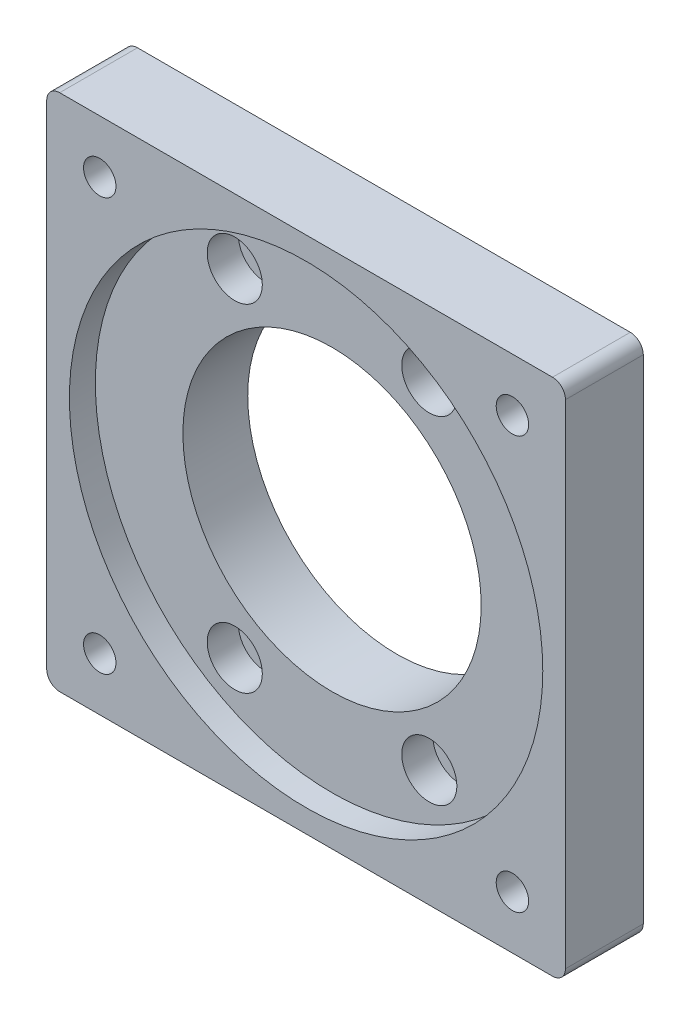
ISO-10303-21;
HEADER;
FILE_DESCRIPTION(('STEP AP214'),'2;1');
FILE_NAME('part.step','',(''),(''),'','','');
FILE_SCHEMA(('AUTOMOTIVE_DESIGN { 1 0 10303 214 1 1 1 1 }'));
ENDSEC;
DATA;
#1=APPLICATION_CONTEXT('core data for automotive mechanical design processes');
#2=APPLICATION_PROTOCOL_DEFINITION('international standard','automotive_design',2000,#1);
#3=PRODUCT_CONTEXT('',#1,'mechanical');
#4=PRODUCT('Part','Part','',(#3));
#5=PRODUCT_RELATED_PRODUCT_CATEGORY('part','',(#4));
#6=PRODUCT_DEFINITION_FORMATION('','',#4);
#7=PRODUCT_DEFINITION_CONTEXT('part definition',#1,'design');
#8=PRODUCT_DEFINITION('design','',#6,#7);
#9=PRODUCT_DEFINITION_SHAPE('','',#8);
#10=(LENGTH_UNIT() NAMED_UNIT(*) SI_UNIT(.MILLI.,.METRE.));
#11=(NAMED_UNIT(*) PLANE_ANGLE_UNIT() SI_UNIT($,.RADIAN.));
#12=(NAMED_UNIT(*) SI_UNIT($,.STERADIAN.) SOLID_ANGLE_UNIT());
#13=UNCERTAINTY_MEASURE_WITH_UNIT(LENGTH_MEASURE(1.E-05),#10,'distance_accuracy_value','');
#14=(GEOMETRIC_REPRESENTATION_CONTEXT(3) GLOBAL_UNCERTAINTY_ASSIGNED_CONTEXT((#13)) GLOBAL_UNIT_ASSIGNED_CONTEXT((#10,
#11,#12)) REPRESENTATION_CONTEXT('',''));
#15=CARTESIAN_POINT('',(0.,0.,0.));
#16=DIRECTION('',(0.,0.,1.));
#17=DIRECTION('',(1.,0.,0.));
#18=AXIS2_PLACEMENT_3D('',#15,#16,#17);
#19=CARTESIAN_POINT('',(0.,0.,12.));
#20=DIRECTION('',(0.,0.,-1.));
#21=DIRECTION('',(-1.,0.,0.));
#22=AXIS2_PLACEMENT_3D('',#19,#20,#21);
#23=PLANE('',#22);
#24=CARTESIAN_POINT('',(-31.8198051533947,31.8198051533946,12.));
#25=DIRECTION('',(0.,0.,1.));
#26=DIRECTION('',(1.,0.,0.));
#27=AXIS2_PLACEMENT_3D('',#24,#25,#26);
#28=CIRCLE('',#27,2.5);
#29=CARTESIAN_POINT('',(-29.3198051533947,31.8198051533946,12.));
#30=VERTEX_POINT('',#29);
#31=EDGE_CURVE('E267',#30,#30,#28,.T.);
#32=ORIENTED_EDGE('',*,*,#31,.F.);
#33=EDGE_LOOP('',(#32));
#34=FACE_BOUND('',#33,.T.);
#35=DIRECTION('',(-1.,0.,0.));
#36=VECTOR('',#35,1.);
#37=CARTESIAN_POINT('',(-40.,40.,12.));
#38=LINE('',#37,#36);
#39=CARTESIAN_POINT('',(38.,40.,12.));
#40=VERTEX_POINT('',#39);
#41=CARTESIAN_POINT('',(-38.,40.,12.));
#42=VERTEX_POINT('',#41);
#43=EDGE_CURVE('E198',#40,#42,#38,.T.);
#44=ORIENTED_EDGE('',*,*,#43,.T.);
#45=CARTESIAN_POINT('',(-38.,38.,12.));
#46=DIRECTION('',(0.,0.,-1.));
#47=DIRECTION('',(-1.,0.,0.));
#48=AXIS2_PLACEMENT_3D('',#45,#46,#47);
#49=CIRCLE('',#48,2.);
#50=CARTESIAN_POINT('',(-40.,38.,12.));
#51=VERTEX_POINT('',#50);
#52=EDGE_CURVE('E178',#42,#51,#49,.F.);
#53=ORIENTED_EDGE('',*,*,#52,.T.);
#54=DIRECTION('',(0.,-1.,0.));
#55=VECTOR('',#54,1.);
#56=CARTESIAN_POINT('',(-40.,-40.,12.));
#57=LINE('',#56,#55);
#58=CARTESIAN_POINT('',(-40.,-38.,12.));
#59=VERTEX_POINT('',#58);
#60=EDGE_CURVE('E124',#51,#59,#57,.T.);
#61=ORIENTED_EDGE('',*,*,#60,.T.);
#62=CARTESIAN_POINT('',(-38.,-38.,12.));
#63=DIRECTION('',(0.,0.,-1.));
#64=DIRECTION('',(-1.,0.,0.));
#65=AXIS2_PLACEMENT_3D('',#62,#63,#64);
#66=CIRCLE('',#65,2.);
#67=CARTESIAN_POINT('',(-38.,-40.,12.));
#68=VERTEX_POINT('',#67);
#69=EDGE_CURVE('E60',#59,#68,#66,.F.);
#70=ORIENTED_EDGE('',*,*,#69,.T.);
#71=DIRECTION('',(1.,0.,0.));
#72=VECTOR('',#71,1.);
#73=CARTESIAN_POINT('',(-40.,-40.,12.));
#74=LINE('',#73,#72);
#75=CARTESIAN_POINT('',(38.,-40.,12.));
#76=VERTEX_POINT('',#75);
#77=EDGE_CURVE('E164',#68,#76,#74,.T.);
#78=ORIENTED_EDGE('',*,*,#77,.T.);
#79=CARTESIAN_POINT('',(38.,-38.,12.));
#80=DIRECTION('',(0.,0.,-1.));
#81=DIRECTION('',(-1.,0.,0.));
#82=AXIS2_PLACEMENT_3D('',#79,#80,#81);
#83=CIRCLE('',#82,2.);
#84=CARTESIAN_POINT('',(40.,-38.,12.));
#85=VERTEX_POINT('',#84);
#86=EDGE_CURVE('E175',#76,#85,#83,.F.);
#87=ORIENTED_EDGE('',*,*,#86,.T.);
#88=DIRECTION('',(0.,1.,0.));
#89=VECTOR('',#88,1.);
#90=CARTESIAN_POINT('',(40.,-40.,12.));
#91=LINE('',#90,#89);
#92=CARTESIAN_POINT('',(40.,38.,12.));
#93=VERTEX_POINT('',#92);
#94=EDGE_CURVE('E134',#85,#93,#91,.T.);
#95=ORIENTED_EDGE('',*,*,#94,.T.);
#96=CARTESIAN_POINT('',(38.,38.,12.));
#97=DIRECTION('',(0.,0.,-1.));
#98=DIRECTION('',(-1.,0.,0.));
#99=AXIS2_PLACEMENT_3D('',#96,#97,#98);
#100=CIRCLE('',#99,2.);
#101=EDGE_CURVE('E173',#93,#40,#100,.F.);
#102=ORIENTED_EDGE('',*,*,#101,.T.);
#103=EDGE_LOOP('',(#44,#53,#61,#70,#78,#87,#95,#102));
#104=FACE_BOUND('',#103,.T.);
#105=CARTESIAN_POINT('',(0.,0.,12.));
#106=DIRECTION('',(0.,0.,1.));
#107=DIRECTION('',(1.,0.,0.));
#108=AXIS2_PLACEMENT_3D('',#105,#106,#107);
#109=CIRCLE('',#108,36.5);
#110=CARTESIAN_POINT('',(36.5,0.,12.));
#111=VERTEX_POINT('',#110);
#112=EDGE_CURVE('E207',#111,#111,#109,.T.);
#113=ORIENTED_EDGE('',*,*,#112,.F.);
#114=EDGE_LOOP('',(#113));
#115=FACE_BOUND('',#114,.T.);
#116=CARTESIAN_POINT('',(-31.8198051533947,-31.8198051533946,12.));
#117=DIRECTION('',(0.,0.,1.));
#118=DIRECTION('',(1.,0.,0.));
#119=AXIS2_PLACEMENT_3D('',#116,#117,#118);
#120=CIRCLE('',#119,2.5);
#121=CARTESIAN_POINT('',(-29.3198051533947,-31.8198051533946,12.));
#122=VERTEX_POINT('',#121);
#123=EDGE_CURVE('E252',#122,#122,#120,.T.);
#124=ORIENTED_EDGE('',*,*,#123,.F.);
#125=EDGE_LOOP('',(#124));
#126=FACE_BOUND('',#125,.T.);
#127=CARTESIAN_POINT('',(31.8198051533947,-31.8198051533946,12.));
#128=DIRECTION('',(0.,0.,1.));
#129=DIRECTION('',(1.,0.,0.));
#130=AXIS2_PLACEMENT_3D('',#127,#128,#129);
#131=CIRCLE('',#130,2.5);
#132=CARTESIAN_POINT('',(34.3198051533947,-31.8198051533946,12.));
#133=VERTEX_POINT('',#132);
#134=EDGE_CURVE('E258',#133,#133,#131,.T.);
#135=ORIENTED_EDGE('',*,*,#134,.F.);
#136=EDGE_LOOP('',(#135));
#137=FACE_BOUND('',#136,.T.);
#138=CARTESIAN_POINT('',(31.8198051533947,31.8198051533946,12.));
#139=DIRECTION('',(0.,0.,1.));
#140=DIRECTION('',(1.,0.,0.));
#141=AXIS2_PLACEMENT_3D('',#138,#139,#140);
#142=CIRCLE('',#141,2.5);
#143=CARTESIAN_POINT('',(34.3198051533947,31.8198051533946,12.));
#144=VERTEX_POINT('',#143);
#145=EDGE_CURVE('E264',#144,#144,#142,.T.);
#146=ORIENTED_EDGE('',*,*,#145,.F.);
#147=EDGE_LOOP('',(#146));
#148=FACE_BOUND('',#147,.T.);
#149=ADVANCED_FACE('F37',(#34,#104,#115,#126,#137,#148),#23,.F.);
#150=CARTESIAN_POINT('',(0.,0.,0.));
#151=DIRECTION('',(0.,0.,-1.));
#152=DIRECTION('',(-1.,0.,0.));
#153=AXIS2_PLACEMENT_3D('',#150,#151,#152);
#154=PLANE('',#153);
#155=CARTESIAN_POINT('',(-31.8198051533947,31.8198051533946,0.));
#156=DIRECTION('',(0.,0.,-1.));
#157=DIRECTION('',(-1.,0.,0.));
#158=AXIS2_PLACEMENT_3D('',#155,#156,#157);
#159=CIRCLE('',#158,2.5);
#160=CARTESIAN_POINT('',(-34.3198051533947,31.8198051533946,0.));
#161=VERTEX_POINT('',#160);
#162=EDGE_CURVE('E41',#161,#161,#159,.T.);
#163=ORIENTED_EDGE('',*,*,#162,.F.);
#164=EDGE_LOOP('',(#163));
#165=FACE_BOUND('',#164,.T.);
#166=CARTESIAN_POINT('',(31.8198051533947,31.8198051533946,0.));
#167=DIRECTION('',(0.,0.,-1.));
#168=DIRECTION('',(-1.,0.,0.));
#169=AXIS2_PLACEMENT_3D('',#166,#167,#168);
#170=CIRCLE('',#169,2.5);
#171=CARTESIAN_POINT('',(29.3198051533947,31.8198051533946,0.));
#172=VERTEX_POINT('',#171);
#173=EDGE_CURVE('E261',#172,#172,#170,.T.);
#174=ORIENTED_EDGE('',*,*,#173,.F.);
#175=EDGE_LOOP('',(#174));
#176=FACE_BOUND('',#175,.T.);
#177=CARTESIAN_POINT('',(31.8198051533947,-31.8198051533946,0.));
#178=DIRECTION('',(0.,0.,-1.));
#179=DIRECTION('',(-1.,0.,0.));
#180=AXIS2_PLACEMENT_3D('',#177,#178,#179);
#181=CIRCLE('',#180,2.5);
#182=CARTESIAN_POINT('',(29.3198051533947,-31.8198051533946,0.));
#183=VERTEX_POINT('',#182);
#184=EDGE_CURVE('E255',#183,#183,#181,.T.);
#185=ORIENTED_EDGE('',*,*,#184,.F.);
#186=EDGE_LOOP('',(#185));
#187=FACE_BOUND('',#186,.T.);
#188=CARTESIAN_POINT('',(-31.8198051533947,-31.8198051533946,0.));
#189=DIRECTION('',(0.,0.,-1.));
#190=DIRECTION('',(-1.,0.,0.));
#191=AXIS2_PLACEMENT_3D('',#188,#189,#190);
#192=CIRCLE('',#191,2.5);
#193=CARTESIAN_POINT('',(-34.3198051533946,-31.8198051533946,0.));
#194=VERTEX_POINT('',#193);
#195=EDGE_CURVE('E249',#194,#194,#192,.T.);
#196=ORIENTED_EDGE('',*,*,#195,.F.);
#197=EDGE_LOOP('',(#196));
#198=FACE_BOUND('',#197,.T.);
#199=DIRECTION('',(0.,-1.,0.));
#200=VECTOR('',#199,1.);
#201=CARTESIAN_POINT('',(-40.,-40.,0.));
#202=LINE('',#201,#200);
#203=CARTESIAN_POINT('',(-40.,38.,0.));
#204=VERTEX_POINT('',#203);
#205=CARTESIAN_POINT('',(-40.,-38.,0.));
#206=VERTEX_POINT('',#205);
#207=EDGE_CURVE('E122',#204,#206,#202,.T.);
#208=ORIENTED_EDGE('',*,*,#207,.F.);
#209=CARTESIAN_POINT('',(-38.,38.,0.));
#210=DIRECTION('',(0.,0.,-1.));
#211=DIRECTION('',(-1.,0.,0.));
#212=AXIS2_PLACEMENT_3D('',#209,#210,#211);
#213=CIRCLE('',#212,2.);
#214=CARTESIAN_POINT('',(-38.,40.,0.));
#215=VERTEX_POINT('',#214);
#216=EDGE_CURVE('E105',#204,#215,#213,.T.);
#217=ORIENTED_EDGE('',*,*,#216,.T.);
#218=DIRECTION('',(-1.,0.,0.));
#219=VECTOR('',#218,1.);
#220=CARTESIAN_POINT('',(-40.,40.,0.));
#221=LINE('',#220,#219);
#222=CARTESIAN_POINT('',(38.,40.,0.));
#223=VERTEX_POINT('',#222);
#224=EDGE_CURVE('E132',#223,#215,#221,.T.);
#225=ORIENTED_EDGE('',*,*,#224,.F.);
#226=CARTESIAN_POINT('',(38.,38.,0.));
#227=DIRECTION('',(0.,0.,-1.));
#228=DIRECTION('',(-1.,0.,0.));
#229=AXIS2_PLACEMENT_3D('',#226,#227,#228);
#230=CIRCLE('',#229,2.);
#231=CARTESIAN_POINT('',(40.,38.,0.));
#232=VERTEX_POINT('',#231);
#233=EDGE_CURVE('E125',#223,#232,#230,.T.);
#234=ORIENTED_EDGE('',*,*,#233,.T.);
#235=DIRECTION('',(0.,1.,0.));
#236=VECTOR('',#235,1.);
#237=CARTESIAN_POINT('',(40.,-40.,0.));
#238=LINE('',#237,#236);
#239=CARTESIAN_POINT('',(40.,-38.,0.));
#240=VERTEX_POINT('',#239);
#241=EDGE_CURVE('E136',#240,#232,#238,.T.);
#242=ORIENTED_EDGE('',*,*,#241,.F.);
#243=CARTESIAN_POINT('',(38.,-38.,0.));
#244=DIRECTION('',(0.,0.,-1.));
#245=DIRECTION('',(-1.,0.,0.));
#246=AXIS2_PLACEMENT_3D('',#243,#244,#245);
#247=CIRCLE('',#246,2.);
#248=CARTESIAN_POINT('',(38.,-40.,0.));
#249=VERTEX_POINT('',#248);
#250=EDGE_CURVE('E167',#240,#249,#247,.T.);
#251=ORIENTED_EDGE('',*,*,#250,.T.);
#252=DIRECTION('',(1.,0.,0.));
#253=VECTOR('',#252,1.);
#254=CARTESIAN_POINT('',(-40.,-40.,0.));
#255=LINE('',#254,#253);
#256=CARTESIAN_POINT('',(-38.,-40.,0.));
#257=VERTEX_POINT('',#256);
#258=EDGE_CURVE('E131',#257,#249,#255,.T.);
#259=ORIENTED_EDGE('',*,*,#258,.F.);
#260=CARTESIAN_POINT('',(-38.,-38.,0.));
#261=DIRECTION('',(0.,0.,-1.));
#262=DIRECTION('',(-1.,0.,0.));
#263=AXIS2_PLACEMENT_3D('',#260,#261,#262);
#264=CIRCLE('',#263,2.);
#265=EDGE_CURVE('E116',#257,#206,#264,.T.);
#266=ORIENTED_EDGE('',*,*,#265,.T.);
#267=EDGE_LOOP('',(#208,#217,#225,#234,#242,#251,#259,#266));
#268=FACE_BOUND('',#267,.T.);
#269=CARTESIAN_POINT('',(-15.,25.9807621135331,0.));
#270=DIRECTION('',(0.,0.,1.));
#271=DIRECTION('',(1.,0.,0.));
#272=AXIS2_PLACEMENT_3D('',#269,#270,#271);
#273=CIRCLE('',#272,2.25);
#274=CARTESIAN_POINT('',(-12.75,25.9807621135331,0.));
#275=VERTEX_POINT('',#274);
#276=EDGE_CURVE('E210',#275,#275,#273,.T.);
#277=ORIENTED_EDGE('',*,*,#276,.T.);
#278=EDGE_LOOP('',(#277));
#279=FACE_BOUND('',#278,.T.);
#280=CARTESIAN_POINT('',(15.,25.9807621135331,0.));
#281=DIRECTION('',(0.,0.,1.));
#282=DIRECTION('',(1.,0.,0.));
#283=AXIS2_PLACEMENT_3D('',#280,#281,#282);
#284=CIRCLE('',#283,2.25);
#285=CARTESIAN_POINT('',(17.25,25.9807621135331,0.));
#286=VERTEX_POINT('',#285);
#287=EDGE_CURVE('E215',#286,#286,#284,.T.);
#288=ORIENTED_EDGE('',*,*,#287,.T.);
#289=EDGE_LOOP('',(#288));
#290=FACE_BOUND('',#289,.T.);
#291=CARTESIAN_POINT('',(15.,-25.9807621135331,0.));
#292=DIRECTION('',(0.,0.,1.));
#293=DIRECTION('',(1.,0.,0.));
#294=AXIS2_PLACEMENT_3D('',#291,#292,#293);
#295=CIRCLE('',#294,2.25);
#296=CARTESIAN_POINT('',(17.25,-25.9807621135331,0.));
#297=VERTEX_POINT('',#296);
#298=EDGE_CURVE('E218',#297,#297,#295,.T.);
#299=ORIENTED_EDGE('',*,*,#298,.T.);
#300=EDGE_LOOP('',(#299));
#301=FACE_BOUND('',#300,.T.);
#302=CARTESIAN_POINT('',(-15.,-25.9807621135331,0.));
#303=DIRECTION('',(0.,0.,1.));
#304=DIRECTION('',(1.,0.,0.));
#305=AXIS2_PLACEMENT_3D('',#302,#303,#304);
#306=CIRCLE('',#305,2.25);
#307=CARTESIAN_POINT('',(-12.75,-25.9807621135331,0.));
#308=VERTEX_POINT('',#307);
#309=EDGE_CURVE('E147',#308,#308,#306,.T.);
#310=ORIENTED_EDGE('',*,*,#309,.T.);
#311=EDGE_LOOP('',(#310));
#312=FACE_BOUND('',#311,.T.);
#313=CARTESIAN_POINT('',(0.,0.,0.));
#314=DIRECTION('',(0.,0.,-1.));
#315=DIRECTION('',(-1.,0.,0.));
#316=AXIS2_PLACEMENT_3D('',#313,#314,#315);
#317=CIRCLE('',#316,25.);
#318=CARTESIAN_POINT('',(-25.,0.,0.));
#319=VERTEX_POINT('',#318);
#320=EDGE_CURVE('E241',#319,#319,#317,.T.);
#321=ORIENTED_EDGE('',*,*,#320,.F.);
#322=EDGE_LOOP('',(#321));
#323=FACE_BOUND('',#322,.T.);
#324=ADVANCED_FACE('F128',(#165,#176,#187,#198,#268,#279,#290,#301,#312,#323),#154,.T.);
#325=CARTESIAN_POINT('',(-15.,-25.9807621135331,0.));
#326=DIRECTION('',(0.,0.,1.));
#327=DIRECTION('',(1.,0.,0.));
#328=AXIS2_PLACEMENT_3D('',#325,#326,#327);
#329=CYLINDRICAL_SURFACE('',#328,2.25);
#330=ORIENTED_EDGE('',*,*,#309,.F.);
#331=EDGE_LOOP('',(#330));
#332=FACE_BOUND('',#331,.T.);
#333=CARTESIAN_POINT('',(-15.,-25.9807621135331,3.2));
#334=DIRECTION('',(0.,0.,1.));
#335=DIRECTION('',(1.,0.,0.));
#336=AXIS2_PLACEMENT_3D('',#333,#334,#335);
#337=CIRCLE('',#336,2.25);
#338=CARTESIAN_POINT('',(-12.75,-25.9807621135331,3.2));
#339=VERTEX_POINT('',#338);
#340=EDGE_CURVE('E159',#339,#339,#337,.F.);
#341=ORIENTED_EDGE('',*,*,#340,.F.);
#342=EDGE_LOOP('',(#341));
#343=FACE_BOUND('',#342,.T.);
#344=ADVANCED_FACE('F278',(#332,#343),#329,.F.);
#345=CARTESIAN_POINT('',(15.,-25.9807621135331,0.));
#346=DIRECTION('',(0.,0.,1.));
#347=DIRECTION('',(1.,0.,0.));
#348=AXIS2_PLACEMENT_3D('',#345,#346,#347);
#349=CYLINDRICAL_SURFACE('',#348,2.25);
#350=ORIENTED_EDGE('',*,*,#298,.F.);
#351=EDGE_LOOP('',(#350));
#352=FACE_BOUND('',#351,.T.);
#353=CARTESIAN_POINT('',(15.,-25.9807621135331,3.2));
#354=DIRECTION('',(0.,0.,1.));
#355=DIRECTION('',(1.,0.,0.));
#356=AXIS2_PLACEMENT_3D('',#353,#354,#355);
#357=CIRCLE('',#356,2.25);
#358=CARTESIAN_POINT('',(17.25,-25.9807621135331,3.2));
#359=VERTEX_POINT('',#358);
#360=EDGE_CURVE('E154',#359,#359,#357,.F.);
#361=ORIENTED_EDGE('',*,*,#360,.F.);
#362=EDGE_LOOP('',(#361));
#363=FACE_BOUND('',#362,.T.);
#364=ADVANCED_FACE('F356',(#352,#363),#349,.F.);
#365=CARTESIAN_POINT('',(15.,25.9807621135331,0.));
#366=DIRECTION('',(0.,0.,1.));
#367=DIRECTION('',(1.,0.,0.));
#368=AXIS2_PLACEMENT_3D('',#365,#366,#367);
#369=CYLINDRICAL_SURFACE('',#368,2.25);
#370=ORIENTED_EDGE('',*,*,#287,.F.);
#371=EDGE_LOOP('',(#370));
#372=FACE_BOUND('',#371,.T.);
#373=CARTESIAN_POINT('',(15.,25.9807621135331,3.2));
#374=DIRECTION('',(0.,0.,1.));
#375=DIRECTION('',(1.,0.,0.));
#376=AXIS2_PLACEMENT_3D('',#373,#374,#375);
#377=CIRCLE('',#376,2.25);
#378=CARTESIAN_POINT('',(17.25,25.9807621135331,3.2));
#379=VERTEX_POINT('',#378);
#380=EDGE_CURVE('E149',#379,#379,#377,.F.);
#381=ORIENTED_EDGE('',*,*,#380,.F.);
#382=EDGE_LOOP('',(#381));
#383=FACE_BOUND('',#382,.T.);
#384=ADVANCED_FACE('F360',(#372,#383),#369,.F.);
#385=CARTESIAN_POINT('',(-15.,25.9807621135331,0.));
#386=DIRECTION('',(0.,0.,1.));
#387=DIRECTION('',(1.,0.,0.));
#388=AXIS2_PLACEMENT_3D('',#385,#386,#387);
#389=CYLINDRICAL_SURFACE('',#388,2.25);
#390=ORIENTED_EDGE('',*,*,#276,.F.);
#391=EDGE_LOOP('',(#390));
#392=FACE_BOUND('',#391,.T.);
#393=CARTESIAN_POINT('',(-15.,25.9807621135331,3.2));
#394=DIRECTION('',(0.,0.,1.));
#395=DIRECTION('',(1.,0.,0.));
#396=AXIS2_PLACEMENT_3D('',#393,#394,#395);
#397=CIRCLE('',#396,2.25);
#398=CARTESIAN_POINT('',(-12.75,25.9807621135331,3.2));
#399=VERTEX_POINT('',#398);
#400=EDGE_CURVE('E144',#399,#399,#397,.F.);
#401=ORIENTED_EDGE('',*,*,#400,.F.);
#402=EDGE_LOOP('',(#401));
#403=FACE_BOUND('',#402,.T.);
#404=ADVANCED_FACE('F364',(#392,#403),#389,.F.);
#405=CARTESIAN_POINT('',(0.,0.,12.));
#406=DIRECTION('',(0.,0.,-1.));
#407=DIRECTION('',(-1.,0.,0.));
#408=AXIS2_PLACEMENT_3D('',#405,#406,#407);
#409=CYLINDRICAL_SURFACE('',#408,23.);
#410=CARTESIAN_POINT('',(0.,0.,8.));
#411=DIRECTION('',(0.,0.,1.));
#412=DIRECTION('',(1.,0.,0.));
#413=AXIS2_PLACEMENT_3D('',#410,#411,#412);
#414=CIRCLE('',#413,23.);
#415=CARTESIAN_POINT('',(23.,0.,8.));
#416=VERTEX_POINT('',#415);
#417=EDGE_CURVE('E140',#416,#416,#414,.T.);
#418=ORIENTED_EDGE('',*,*,#417,.T.);
#419=EDGE_LOOP('',(#418));
#420=FACE_BOUND('',#419,.T.);
#421=CARTESIAN_POINT('',(0.,0.,-2.));
#422=DIRECTION('',(0.,0.,-1.));
#423=DIRECTION('',(-1.,0.,0.));
#424=AXIS2_PLACEMENT_3D('',#421,#422,#423);
#425=CIRCLE('',#424,23.);
#426=CARTESIAN_POINT('',(-23.,0.,-2.));
#427=VERTEX_POINT('',#426);
#428=EDGE_CURVE('E244',#427,#427,#425,.T.);
#429=ORIENTED_EDGE('',*,*,#428,.T.);
#430=EDGE_LOOP('',(#429));
#431=FACE_BOUND('',#430,.T.);
#432=ADVANCED_FACE('F368',(#420,#431),#409,.F.);
#433=CARTESIAN_POINT('',(40.,-40.,12.));
#434=DIRECTION('',(-1.,0.,0.));
#435=DIRECTION('',(0.,0.,1.));
#436=AXIS2_PLACEMENT_3D('',#433,#434,#435);
#437=PLANE('',#436);
#438=ORIENTED_EDGE('',*,*,#94,.F.);
#439=DIRECTION('',(0.,0.,-1.));
#440=VECTOR('',#439,1.);
#441=CARTESIAN_POINT('',(40.,-38.,12.));
#442=LINE('',#441,#440);
#443=EDGE_CURVE('E11',#85,#240,#442,.T.);
#444=ORIENTED_EDGE('',*,*,#443,.T.);
#445=ORIENTED_EDGE('',*,*,#241,.T.);
#446=DIRECTION('',(0.,0.,-1.));
#447=VECTOR('',#446,1.);
#448=CARTESIAN_POINT('',(40.,38.,12.));
#449=LINE('',#448,#447);
#450=EDGE_CURVE('E46',#232,#93,#449,.F.);
#451=ORIENTED_EDGE('',*,*,#450,.T.);
#452=EDGE_LOOP('',(#438,#444,#445,#451));
#453=FACE_BOUND('',#452,.T.);
#454=ADVANCED_FACE('F189',(#453),#437,.F.);
#455=CARTESIAN_POINT('',(-40.,40.,12.));
#456=DIRECTION('',(0.,-1.,0.));
#457=DIRECTION('',(0.,0.,-1.));
#458=AXIS2_PLACEMENT_3D('',#455,#456,#457);
#459=PLANE('',#458);
#460=ORIENTED_EDGE('',*,*,#224,.T.);
#461=DIRECTION('',(0.,0.,-1.));
#462=VECTOR('',#461,1.);
#463=CARTESIAN_POINT('',(-38.,40.,12.));
#464=LINE('',#463,#462);
#465=EDGE_CURVE('E110',#215,#42,#464,.F.);
#466=ORIENTED_EDGE('',*,*,#465,.T.);
#467=ORIENTED_EDGE('',*,*,#43,.F.);
#468=DIRECTION('',(0.,0.,-1.));
#469=VECTOR('',#468,1.);
#470=CARTESIAN_POINT('',(38.,40.,12.));
#471=LINE('',#470,#469);
#472=EDGE_CURVE('E115',#40,#223,#471,.T.);
#473=ORIENTED_EDGE('',*,*,#472,.T.);
#474=EDGE_LOOP('',(#460,#466,#467,#473));
#475=FACE_BOUND('',#474,.T.);
#476=ADVANCED_FACE('F202',(#475),#459,.F.);
#477=CARTESIAN_POINT('',(-40.,-40.,12.));
#478=DIRECTION('',(1.,0.,0.));
#479=DIRECTION('',(0.,0.,-1.));
#480=AXIS2_PLACEMENT_3D('',#477,#478,#479);
#481=PLANE('',#480);
#482=ORIENTED_EDGE('',*,*,#60,.F.);
#483=DIRECTION('',(0.,0.,-1.));
#484=VECTOR('',#483,1.);
#485=CARTESIAN_POINT('',(-40.,38.,12.));
#486=LINE('',#485,#484);
#487=EDGE_CURVE('E109',#51,#204,#486,.T.);
#488=ORIENTED_EDGE('',*,*,#487,.T.);
#489=ORIENTED_EDGE('',*,*,#207,.T.);
#490=DIRECTION('',(0.,0.,-1.));
#491=VECTOR('',#490,1.);
#492=CARTESIAN_POINT('',(-40.,-38.,12.));
#493=LINE('',#492,#491);
#494=EDGE_CURVE('E126',#206,#59,#493,.F.);
#495=ORIENTED_EDGE('',*,*,#494,.T.);
#496=EDGE_LOOP('',(#482,#488,#489,#495));
#497=FACE_BOUND('',#496,.T.);
#498=ADVANCED_FACE('F121',(#497),#481,.F.);
#499=CARTESIAN_POINT('',(-40.,-40.,12.));
#500=DIRECTION('',(0.,1.,0.));
#501=DIRECTION('',(0.,0.,1.));
#502=AXIS2_PLACEMENT_3D('',#499,#500,#501);
#503=PLANE('',#502);
#504=ORIENTED_EDGE('',*,*,#77,.F.);
#505=DIRECTION('',(0.,0.,-1.));
#506=VECTOR('',#505,1.);
#507=CARTESIAN_POINT('',(-38.,-40.,12.));
#508=LINE('',#507,#506);
#509=EDGE_CURVE('E181',#68,#257,#508,.T.);
#510=ORIENTED_EDGE('',*,*,#509,.T.);
#511=ORIENTED_EDGE('',*,*,#258,.T.);
#512=DIRECTION('',(0.,0.,-1.));
#513=VECTOR('',#512,1.);
#514=CARTESIAN_POINT('',(38.,-40.,12.));
#515=LINE('',#514,#513);
#516=EDGE_CURVE('E53',#249,#76,#515,.F.);
#517=ORIENTED_EDGE('',*,*,#516,.T.);
#518=EDGE_LOOP('',(#504,#510,#511,#517));
#519=FACE_BOUND('',#518,.T.);
#520=ADVANCED_FACE('F376',(#519),#503,.F.);
#521=CARTESIAN_POINT('',(0.,0.,8.));
#522=DIRECTION('',(0.,0.,1.));
#523=DIRECTION('',(1.,0.,0.));
#524=AXIS2_PLACEMENT_3D('',#521,#522,#523);
#525=CYLINDRICAL_SURFACE('',#524,36.5);
#526=CARTESIAN_POINT('',(0.,0.,8.));
#527=DIRECTION('',(0.,0.,1.));
#528=DIRECTION('',(1.,0.,0.));
#529=AXIS2_PLACEMENT_3D('',#526,#527,#528);
#530=CIRCLE('',#529,36.5);
#531=CARTESIAN_POINT('',(36.5,0.,8.));
#532=VERTEX_POINT('',#531);
#533=EDGE_CURVE('E143',#532,#532,#530,.T.);
#534=ORIENTED_EDGE('',*,*,#533,.F.);
#535=EDGE_LOOP('',(#534));
#536=FACE_BOUND('',#535,.T.);
#537=ORIENTED_EDGE('',*,*,#112,.T.);
#538=EDGE_LOOP('',(#537));
#539=FACE_BOUND('',#538,.T.);
#540=ADVANCED_FACE('F372',(#536,#539),#525,.F.);
#541=CARTESIAN_POINT('',(0.,0.,8.));
#542=DIRECTION('',(0.,0.,1.));
#543=DIRECTION('',(1.,0.,0.));
#544=AXIS2_PLACEMENT_3D('',#541,#542,#543);
#545=PLANE('',#544);
#546=CARTESIAN_POINT('',(-15.,-25.9807621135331,8.));
#547=DIRECTION('',(0.,0.,1.));
#548=DIRECTION('',(1.,0.,0.));
#549=AXIS2_PLACEMENT_3D('',#546,#547,#548);
#550=CIRCLE('',#549,4.25);
#551=CARTESIAN_POINT('',(-10.75,-25.9807621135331,8.));
#552=VERTEX_POINT('',#551);
#553=EDGE_CURVE('E235',#552,#552,#550,.T.);
#554=ORIENTED_EDGE('',*,*,#553,.F.);
#555=EDGE_LOOP('',(#554));
#556=FACE_BOUND('',#555,.T.);
#557=CARTESIAN_POINT('',(15.,-25.9807621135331,8.));
#558=DIRECTION('',(0.,0.,1.));
#559=DIRECTION('',(1.,0.,0.));
#560=AXIS2_PLACEMENT_3D('',#557,#558,#559);
#561=CIRCLE('',#560,4.25);
#562=CARTESIAN_POINT('',(19.25,-25.9807621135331,8.));
#563=VERTEX_POINT('',#562);
#564=EDGE_CURVE('E162',#563,#563,#561,.T.);
#565=ORIENTED_EDGE('',*,*,#564,.F.);
#566=EDGE_LOOP('',(#565));
#567=FACE_BOUND('',#566,.T.);
#568=CARTESIAN_POINT('',(15.,25.9807621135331,8.));
#569=DIRECTION('',(0.,0.,1.));
#570=DIRECTION('',(1.,0.,0.));
#571=AXIS2_PLACEMENT_3D('',#568,#569,#570);
#572=CIRCLE('',#571,4.25);
#573=CARTESIAN_POINT('',(19.25,25.9807621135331,8.));
#574=VERTEX_POINT('',#573);
#575=EDGE_CURVE('E157',#574,#574,#572,.T.);
#576=ORIENTED_EDGE('',*,*,#575,.F.);
#577=EDGE_LOOP('',(#576));
#578=FACE_BOUND('',#577,.T.);
#579=CARTESIAN_POINT('',(-15.,25.9807621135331,8.));
#580=DIRECTION('',(0.,0.,1.));
#581=DIRECTION('',(1.,0.,0.));
#582=AXIS2_PLACEMENT_3D('',#579,#580,#581);
#583=CIRCLE('',#582,4.25);
#584=CARTESIAN_POINT('',(-10.75,25.9807621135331,8.));
#585=VERTEX_POINT('',#584);
#586=EDGE_CURVE('E152',#585,#585,#583,.T.);
#587=ORIENTED_EDGE('',*,*,#586,.F.);
#588=EDGE_LOOP('',(#587));
#589=FACE_BOUND('',#588,.T.);
#590=ORIENTED_EDGE('',*,*,#417,.F.);
#591=EDGE_LOOP('',(#590));
#592=FACE_BOUND('',#591,.T.);
#593=ORIENTED_EDGE('',*,*,#533,.T.);
#594=EDGE_LOOP('',(#593));
#595=FACE_BOUND('',#594,.T.);
#596=ADVANCED_FACE('F349',(#556,#567,#578,#589,#592,#595),#545,.T.);
#597=CARTESIAN_POINT('',(-15.,25.9807621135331,3.2));
#598=DIRECTION('',(0.,0.,1.));
#599=DIRECTION('',(1.,0.,0.));
#600=AXIS2_PLACEMENT_3D('',#597,#598,#599);
#601=PLANE('',#600);
#602=CARTESIAN_POINT('',(-15.,25.9807621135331,3.2));
#603=DIRECTION('',(0.,0.,1.));
#604=DIRECTION('',(1.,0.,0.));
#605=AXIS2_PLACEMENT_3D('',#602,#603,#604);
#606=CIRCLE('',#605,4.25);
#607=CARTESIAN_POINT('',(-10.75,25.9807621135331,3.2));
#608=VERTEX_POINT('',#607);
#609=EDGE_CURVE('E148',#608,#608,#606,.T.);
#610=ORIENTED_EDGE('',*,*,#609,.T.);
#611=EDGE_LOOP('',(#610));
#612=FACE_BOUND('',#611,.T.);
#613=ORIENTED_EDGE('',*,*,#400,.T.);
#614=EDGE_LOOP('',(#613));
#615=FACE_BOUND('',#614,.T.);
#616=ADVANCED_FACE('F346',(#612,#615),#601,.T.);
#617=CARTESIAN_POINT('',(-15.,25.9807621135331,3.2));
#618=DIRECTION('',(0.,0.,1.));
#619=DIRECTION('',(1.,0.,0.));
#620=AXIS2_PLACEMENT_3D('',#617,#618,#619);
#621=CYLINDRICAL_SURFACE('',#620,4.25);
#622=ORIENTED_EDGE('',*,*,#609,.F.);
#623=EDGE_LOOP('',(#622));
#624=FACE_BOUND('',#623,.T.);
#625=ORIENTED_EDGE('',*,*,#586,.T.);
#626=EDGE_LOOP('',(#625));
#627=FACE_BOUND('',#626,.T.);
#628=ADVANCED_FACE('F341',(#624,#627),#621,.F.);
#629=CARTESIAN_POINT('',(15.,25.9807621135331,3.2));
#630=DIRECTION('',(0.,0.,1.));
#631=DIRECTION('',(1.,0.,0.));
#632=AXIS2_PLACEMENT_3D('',#629,#630,#631);
#633=PLANE('',#632);
#634=CARTESIAN_POINT('',(15.,25.9807621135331,3.2));
#635=DIRECTION('',(0.,0.,1.));
#636=DIRECTION('',(1.,0.,0.));
#637=AXIS2_PLACEMENT_3D('',#634,#635,#636);
#638=CIRCLE('',#637,4.25);
#639=CARTESIAN_POINT('',(19.25,25.9807621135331,3.2));
#640=VERTEX_POINT('',#639);
#641=EDGE_CURVE('E153',#640,#640,#638,.T.);
#642=ORIENTED_EDGE('',*,*,#641,.T.);
#643=EDGE_LOOP('',(#642));
#644=FACE_BOUND('',#643,.T.);
#645=ORIENTED_EDGE('',*,*,#380,.T.);
#646=EDGE_LOOP('',(#645));
#647=FACE_BOUND('',#646,.T.);
#648=ADVANCED_FACE('F338',(#644,#647),#633,.T.);
#649=CARTESIAN_POINT('',(15.,25.9807621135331,3.2));
#650=DIRECTION('',(0.,0.,1.));
#651=DIRECTION('',(1.,0.,0.));
#652=AXIS2_PLACEMENT_3D('',#649,#650,#651);
#653=CYLINDRICAL_SURFACE('',#652,4.25);
#654=ORIENTED_EDGE('',*,*,#641,.F.);
#655=EDGE_LOOP('',(#654));
#656=FACE_BOUND('',#655,.T.);
#657=ORIENTED_EDGE('',*,*,#575,.T.);
#658=EDGE_LOOP('',(#657));
#659=FACE_BOUND('',#658,.T.);
#660=ADVANCED_FACE('F333',(#656,#659),#653,.F.);
#661=CARTESIAN_POINT('',(15.,-25.9807621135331,3.2));
#662=DIRECTION('',(0.,0.,1.));
#663=DIRECTION('',(1.,0.,0.));
#664=AXIS2_PLACEMENT_3D('',#661,#662,#663);
#665=PLANE('',#664);
#666=CARTESIAN_POINT('',(15.,-25.9807621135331,3.2));
#667=DIRECTION('',(0.,0.,1.));
#668=DIRECTION('',(1.,0.,0.));
#669=AXIS2_PLACEMENT_3D('',#666,#667,#668);
#670=CIRCLE('',#669,4.25);
#671=CARTESIAN_POINT('',(19.25,-25.9807621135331,3.2));
#672=VERTEX_POINT('',#671);
#673=EDGE_CURVE('E158',#672,#672,#670,.T.);
#674=ORIENTED_EDGE('',*,*,#673,.T.);
#675=EDGE_LOOP('',(#674));
#676=FACE_BOUND('',#675,.T.);
#677=ORIENTED_EDGE('',*,*,#360,.T.);
#678=EDGE_LOOP('',(#677));
#679=FACE_BOUND('',#678,.T.);
#680=ADVANCED_FACE('F330',(#676,#679),#665,.T.);
#681=CARTESIAN_POINT('',(15.,-25.9807621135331,3.2));
#682=DIRECTION('',(0.,0.,1.));
#683=DIRECTION('',(1.,0.,0.));
#684=AXIS2_PLACEMENT_3D('',#681,#682,#683);
#685=CYLINDRICAL_SURFACE('',#684,4.25);
#686=ORIENTED_EDGE('',*,*,#673,.F.);
#687=EDGE_LOOP('',(#686));
#688=FACE_BOUND('',#687,.T.);
#689=ORIENTED_EDGE('',*,*,#564,.T.);
#690=EDGE_LOOP('',(#689));
#691=FACE_BOUND('',#690,.T.);
#692=ADVANCED_FACE('F325',(#688,#691),#685,.F.);
#693=CARTESIAN_POINT('',(-15.,-25.9807621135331,3.2));
#694=DIRECTION('',(0.,0.,1.));
#695=DIRECTION('',(1.,0.,0.));
#696=AXIS2_PLACEMENT_3D('',#693,#694,#695);
#697=PLANE('',#696);
#698=CARTESIAN_POINT('',(-15.,-25.9807621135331,3.2));
#699=DIRECTION('',(0.,0.,1.));
#700=DIRECTION('',(1.,0.,0.));
#701=AXIS2_PLACEMENT_3D('',#698,#699,#700);
#702=CIRCLE('',#701,4.25);
#703=CARTESIAN_POINT('',(-10.75,-25.9807621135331,3.2));
#704=VERTEX_POINT('',#703);
#705=EDGE_CURVE('E163',#704,#704,#702,.T.);
#706=ORIENTED_EDGE('',*,*,#705,.T.);
#707=EDGE_LOOP('',(#706));
#708=FACE_BOUND('',#707,.T.);
#709=ORIENTED_EDGE('',*,*,#340,.T.);
#710=EDGE_LOOP('',(#709));
#711=FACE_BOUND('',#710,.T.);
#712=ADVANCED_FACE('F321',(#708,#711),#697,.T.);
#713=CARTESIAN_POINT('',(-15.,-25.9807621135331,3.2));
#714=DIRECTION('',(0.,0.,1.));
#715=DIRECTION('',(1.,0.,0.));
#716=AXIS2_PLACEMENT_3D('',#713,#714,#715);
#717=CYLINDRICAL_SURFACE('',#716,4.25);
#718=ORIENTED_EDGE('',*,*,#705,.F.);
#719=EDGE_LOOP('',(#718));
#720=FACE_BOUND('',#719,.T.);
#721=ORIENTED_EDGE('',*,*,#553,.T.);
#722=EDGE_LOOP('',(#721));
#723=FACE_BOUND('',#722,.T.);
#724=ADVANCED_FACE('F324',(#720,#723),#717,.F.);
#725=CARTESIAN_POINT('',(-38.,38.,12.));
#726=DIRECTION('',(0.,0.,-1.));
#727=DIRECTION('',(-1.,0.,0.));
#728=AXIS2_PLACEMENT_3D('',#725,#726,#727);
#729=CYLINDRICAL_SURFACE('',#728,2.);
#730=ORIENTED_EDGE('',*,*,#52,.F.);
#731=ORIENTED_EDGE('',*,*,#465,.F.);
#732=ORIENTED_EDGE('',*,*,#216,.F.);
#733=ORIENTED_EDGE('',*,*,#487,.F.);
#734=EDGE_LOOP('',(#730,#731,#732,#733));
#735=FACE_BOUND('',#734,.T.);
#736=ADVANCED_FACE('F108',(#735),#729,.T.);
#737=CARTESIAN_POINT('',(-38.,-38.,12.));
#738=DIRECTION('',(0.,0.,-1.));
#739=DIRECTION('',(-1.,0.,0.));
#740=AXIS2_PLACEMENT_3D('',#737,#738,#739);
#741=CYLINDRICAL_SURFACE('',#740,2.);
#742=ORIENTED_EDGE('',*,*,#69,.F.);
#743=ORIENTED_EDGE('',*,*,#494,.F.);
#744=ORIENTED_EDGE('',*,*,#265,.F.);
#745=ORIENTED_EDGE('',*,*,#509,.F.);
#746=EDGE_LOOP('',(#742,#743,#744,#745));
#747=FACE_BOUND('',#746,.T.);
#748=ADVANCED_FACE('F391',(#747),#741,.T.);
#749=CARTESIAN_POINT('',(38.,-38.,12.));
#750=DIRECTION('',(0.,0.,-1.));
#751=DIRECTION('',(-1.,0.,0.));
#752=AXIS2_PLACEMENT_3D('',#749,#750,#751);
#753=CYLINDRICAL_SURFACE('',#752,2.);
#754=ORIENTED_EDGE('',*,*,#86,.F.);
#755=ORIENTED_EDGE('',*,*,#516,.F.);
#756=ORIENTED_EDGE('',*,*,#250,.F.);
#757=ORIENTED_EDGE('',*,*,#443,.F.);
#758=EDGE_LOOP('',(#754,#755,#756,#757));
#759=FACE_BOUND('',#758,.T.);
#760=ADVANCED_FACE('F393',(#759),#753,.T.);
#761=CARTESIAN_POINT('',(38.,38.,12.));
#762=DIRECTION('',(0.,0.,-1.));
#763=DIRECTION('',(-1.,0.,0.));
#764=AXIS2_PLACEMENT_3D('',#761,#762,#763);
#765=CYLINDRICAL_SURFACE('',#764,2.);
#766=ORIENTED_EDGE('',*,*,#101,.F.);
#767=ORIENTED_EDGE('',*,*,#450,.F.);
#768=ORIENTED_EDGE('',*,*,#233,.F.);
#769=ORIENTED_EDGE('',*,*,#472,.F.);
#770=EDGE_LOOP('',(#766,#767,#768,#769));
#771=FACE_BOUND('',#770,.T.);
#772=ADVANCED_FACE('F39',(#771),#765,.T.);
#773=CARTESIAN_POINT('',(0.,0.,-2.));
#774=DIRECTION('',(0.,0.,-1.));
#775=DIRECTION('',(-1.,0.,0.));
#776=AXIS2_PLACEMENT_3D('',#773,#774,#775);
#777=PLANE('',#776);
#778=CARTESIAN_POINT('',(0.,0.,-2.));
#779=DIRECTION('',(0.,0.,-1.));
#780=DIRECTION('',(-1.,0.,0.));
#781=AXIS2_PLACEMENT_3D('',#778,#779,#780);
#782=CIRCLE('',#781,25.);
#783=CARTESIAN_POINT('',(-25.,0.,-2.));
#784=VERTEX_POINT('',#783);
#785=EDGE_CURVE('E238',#784,#784,#782,.T.);
#786=ORIENTED_EDGE('',*,*,#785,.T.);
#787=EDGE_LOOP('',(#786));
#788=FACE_BOUND('',#787,.T.);
#789=ORIENTED_EDGE('',*,*,#428,.F.);
#790=EDGE_LOOP('',(#789));
#791=FACE_BOUND('',#790,.T.);
#792=ADVANCED_FACE('F314',(#788,#791),#777,.T.);
#793=CARTESIAN_POINT('',(0.,0.,-2.));
#794=DIRECTION('',(0.,0.,1.));
#795=DIRECTION('',(1.,0.,0.));
#796=AXIS2_PLACEMENT_3D('',#793,#794,#795);
#797=CYLINDRICAL_SURFACE('',#796,25.);
#798=ORIENTED_EDGE('',*,*,#785,.F.);
#799=EDGE_LOOP('',(#798));
#800=FACE_BOUND('',#799,.T.);
#801=ORIENTED_EDGE('',*,*,#320,.T.);
#802=EDGE_LOOP('',(#801));
#803=FACE_BOUND('',#802,.T.);
#804=ADVANCED_FACE('F290',(#800,#803),#797,.T.);
#805=CARTESIAN_POINT('',(-31.8198051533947,-31.8198051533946,12.));
#806=DIRECTION('',(0.,0.,1.));
#807=DIRECTION('',(1.,0.,0.));
#808=AXIS2_PLACEMENT_3D('',#805,#806,#807);
#809=CYLINDRICAL_SURFACE('',#808,2.5);
#810=ORIENTED_EDGE('',*,*,#195,.T.);
#811=EDGE_LOOP('',(#810));
#812=FACE_BOUND('',#811,.T.);
#813=ORIENTED_EDGE('',*,*,#123,.T.);
#814=EDGE_LOOP('',(#813));
#815=FACE_BOUND('',#814,.T.);
#816=ADVANCED_FACE('F286',(#812,#815),#809,.F.);
#817=CARTESIAN_POINT('',(31.8198051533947,-31.8198051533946,12.));
#818=DIRECTION('',(0.,0.,1.));
#819=DIRECTION('',(1.,0.,0.));
#820=AXIS2_PLACEMENT_3D('',#817,#818,#819);
#821=CYLINDRICAL_SURFACE('',#820,2.5);
#822=ORIENTED_EDGE('',*,*,#184,.T.);
#823=EDGE_LOOP('',(#822));
#824=FACE_BOUND('',#823,.T.);
#825=ORIENTED_EDGE('',*,*,#134,.T.);
#826=EDGE_LOOP('',(#825));
#827=FACE_BOUND('',#826,.T.);
#828=ADVANCED_FACE('F289',(#824,#827),#821,.F.);
#829=CARTESIAN_POINT('',(31.8198051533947,31.8198051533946,12.));
#830=DIRECTION('',(0.,0.,1.));
#831=DIRECTION('',(1.,0.,0.));
#832=AXIS2_PLACEMENT_3D('',#829,#830,#831);
#833=CYLINDRICAL_SURFACE('',#832,2.5);
#834=ORIENTED_EDGE('',*,*,#173,.T.);
#835=EDGE_LOOP('',(#834));
#836=FACE_BOUND('',#835,.T.);
#837=ORIENTED_EDGE('',*,*,#145,.T.);
#838=EDGE_LOOP('',(#837));
#839=FACE_BOUND('',#838,.T.);
#840=ADVANCED_FACE('F302',(#836,#839),#833,.F.);
#841=CARTESIAN_POINT('',(-31.8198051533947,31.8198051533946,12.));
#842=DIRECTION('',(0.,0.,1.));
#843=DIRECTION('',(1.,0.,0.));
#844=AXIS2_PLACEMENT_3D('',#841,#842,#843);
#845=CYLINDRICAL_SURFACE('',#844,2.5);
#846=ORIENTED_EDGE('',*,*,#162,.T.);
#847=EDGE_LOOP('',(#846));
#848=FACE_BOUND('',#847,.T.);
#849=ORIENTED_EDGE('',*,*,#31,.T.);
#850=EDGE_LOOP('',(#849));
#851=FACE_BOUND('',#850,.T.);
#852=ADVANCED_FACE('F274',(#848,#851),#845,.F.);
#853=CLOSED_SHELL('',(#149,#324,#344,#364,#384,#404,#432,#454,#476,#498,#520,#540,#596,#616,
#628,#648,#660,#680,#692,#712,#724,#736,#748,#760,#772,#792,#804,#816,#828,#840,#852));
#854=MANIFOLD_SOLID_BREP('B2',#853);
#855=ADVANCED_BREP_SHAPE_REPRESENTATION('',(#18,#854),#14);
#856=SHAPE_DEFINITION_REPRESENTATION(#9,#855);
ENDSEC;
END-ISO-10303-21;
